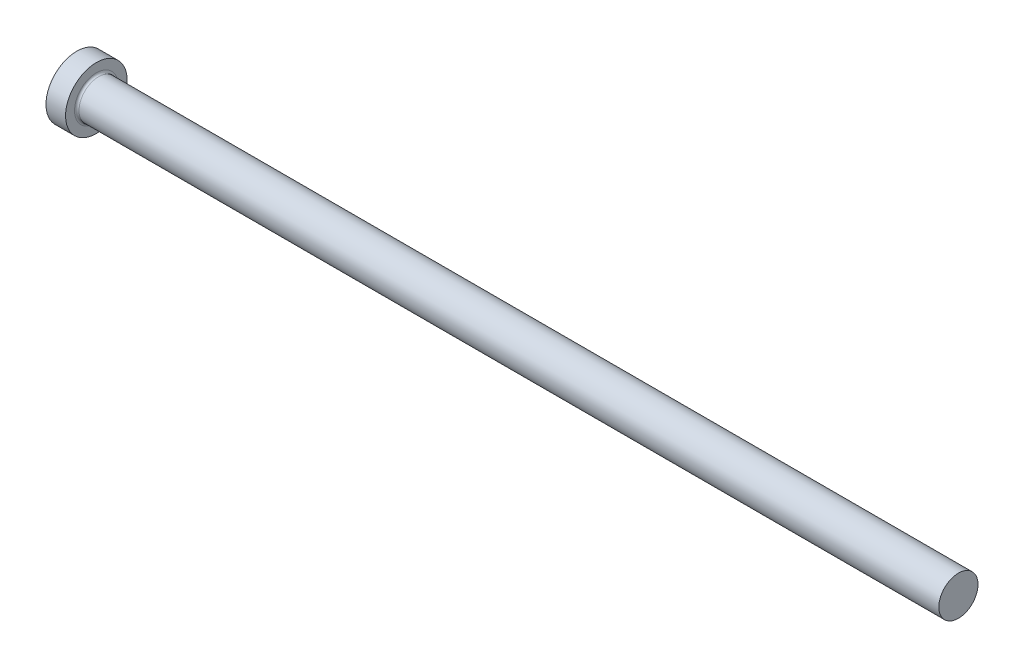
ISO-10303-21;
HEADER;
FILE_DESCRIPTION(('STEP AP214'),'2;1');
FILE_NAME('part.step','',(''),(''),'','','');
FILE_SCHEMA(('AUTOMOTIVE_DESIGN { 1 0 10303 214 1 1 1 1 }'));
ENDSEC;
DATA;
#1=APPLICATION_CONTEXT('core data for automotive mechanical design processes');
#2=APPLICATION_PROTOCOL_DEFINITION('international standard','automotive_design',2000,#1);
#3=PRODUCT_CONTEXT('',#1,'mechanical');
#4=PRODUCT('Part','Part','',(#3));
#5=PRODUCT_RELATED_PRODUCT_CATEGORY('part','',(#4));
#6=PRODUCT_DEFINITION_FORMATION('','',#4);
#7=PRODUCT_DEFINITION_CONTEXT('part definition',#1,'design');
#8=PRODUCT_DEFINITION('design','',#6,#7);
#9=PRODUCT_DEFINITION_SHAPE('','',#8);
#10=(LENGTH_UNIT() NAMED_UNIT(*) SI_UNIT(.MILLI.,.METRE.));
#11=(NAMED_UNIT(*) PLANE_ANGLE_UNIT() SI_UNIT($,.RADIAN.));
#12=(NAMED_UNIT(*) SI_UNIT($,.STERADIAN.) SOLID_ANGLE_UNIT());
#13=UNCERTAINTY_MEASURE_WITH_UNIT(LENGTH_MEASURE(1.E-05),#10,'distance_accuracy_value','');
#14=(GEOMETRIC_REPRESENTATION_CONTEXT(3) GLOBAL_UNCERTAINTY_ASSIGNED_CONTEXT((#13)) GLOBAL_UNIT_ASSIGNED_CONTEXT((#10,
#11,#12)) REPRESENTATION_CONTEXT('',''));
#15=CARTESIAN_POINT('',(0.,0.,0.));
#16=DIRECTION('',(0.,0.,1.));
#17=DIRECTION('',(1.,0.,0.));
#18=AXIS2_PLACEMENT_3D('',#15,#16,#17);
#19=CARTESIAN_POINT('',(0.,0.,0.));
#20=DIRECTION('',(-1.,0.,0.));
#21=DIRECTION('',(0.,-1.,0.));
#22=AXIS2_PLACEMENT_3D('',#19,#20,#21);
#23=PLANE('',#22);
#24=CARTESIAN_POINT('',(0.,0.,0.));
#25=DIRECTION('',(1.,0.,0.));
#26=DIRECTION('',(0.,1.,0.));
#27=AXIS2_PLACEMENT_3D('',#24,#25,#26);
#28=CIRCLE('',#27,11.);
#29=CARTESIAN_POINT('',(0.,11.,0.));
#30=VERTEX_POINT('',#29);
#31=EDGE_CURVE('E25',#30,#30,#28,.T.);
#32=ORIENTED_EDGE('',*,*,#31,.F.);
#33=EDGE_LOOP('',(#32));
#34=FACE_BOUND('',#33,.T.);
#35=ADVANCED_FACE('F14',(#34),#23,.T.);
#36=CARTESIAN_POINT('',(315.,0.,0.));
#37=DIRECTION('',(1.,0.,0.));
#38=DIRECTION('',(0.,1.,0.));
#39=AXIS2_PLACEMENT_3D('',#36,#37,#38);
#40=CYLINDRICAL_SURFACE('',#39,11.);
#41=ORIENTED_EDGE('',*,*,#31,.T.);
#42=EDGE_LOOP('',(#41));
#43=FACE_BOUND('',#42,.T.);
#44=CARTESIAN_POINT('',(7.,0.,0.));
#45=DIRECTION('',(1.,0.,0.));
#46=DIRECTION('',(0.,1.,0.));
#47=AXIS2_PLACEMENT_3D('',#44,#45,#46);
#48=CIRCLE('',#47,11.);
#49=CARTESIAN_POINT('',(7.,11.,0.));
#50=VERTEX_POINT('',#49);
#51=EDGE_CURVE('E29',#50,#50,#48,.T.);
#52=ORIENTED_EDGE('',*,*,#51,.F.);
#53=EDGE_LOOP('',(#52));
#54=FACE_BOUND('',#53,.T.);
#55=ADVANCED_FACE('F51',(#43,#54),#40,.T.);
#56=CARTESIAN_POINT('',(7.,11.,0.));
#57=DIRECTION('',(1.,0.,0.));
#58=DIRECTION('',(0.,1.,0.));
#59=AXIS2_PLACEMENT_3D('',#56,#57,#58);
#60=PLANE('',#59);
#61=CARTESIAN_POINT('',(7.,0.,0.));
#62=DIRECTION('',(1.,0.,0.));
#63=DIRECTION('',(0.,1.,0.));
#64=AXIS2_PLACEMENT_3D('',#61,#62,#63);
#65=CIRCLE('',#64,7.8);
#66=CARTESIAN_POINT('',(7.,7.8,0.));
#67=VERTEX_POINT('',#66);
#68=EDGE_CURVE('E9',#67,#67,#65,.F.);
#69=ORIENTED_EDGE('',*,*,#68,.T.);
#70=EDGE_LOOP('',(#69));
#71=FACE_BOUND('',#70,.T.);
#72=ORIENTED_EDGE('',*,*,#51,.T.);
#73=EDGE_LOOP('',(#72));
#74=FACE_BOUND('',#73,.T.);
#75=ADVANCED_FACE('F42',(#71,#74),#60,.T.);
#76=CARTESIAN_POINT('',(315.,0.,0.));
#77=DIRECTION('',(1.,0.,0.));
#78=DIRECTION('',(0.,1.,0.));
#79=AXIS2_PLACEMENT_3D('',#76,#77,#78);
#80=CYLINDRICAL_SURFACE('',#79,7.);
#81=CARTESIAN_POINT('',(7.8,0.,0.));
#82=DIRECTION('',(1.,0.,0.));
#83=DIRECTION('',(0.,1.,0.));
#84=AXIS2_PLACEMENT_3D('',#81,#82,#83);
#85=CIRCLE('',#84,7.);
#86=CARTESIAN_POINT('',(7.8,7.,0.));
#87=VERTEX_POINT('',#86);
#88=EDGE_CURVE('E21',#87,#87,#85,.T.);
#89=ORIENTED_EDGE('',*,*,#88,.T.);
#90=EDGE_LOOP('',(#89));
#91=FACE_BOUND('',#90,.T.);
#92=CARTESIAN_POINT('',(315.,0.,0.));
#93=DIRECTION('',(1.,0.,0.));
#94=DIRECTION('',(0.,1.,0.));
#95=AXIS2_PLACEMENT_3D('',#92,#93,#94);
#96=CIRCLE('',#95,7.);
#97=CARTESIAN_POINT('',(315.,7.00000000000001,0.));
#98=VERTEX_POINT('',#97);
#99=EDGE_CURVE('E34',#98,#98,#96,.T.);
#100=ORIENTED_EDGE('',*,*,#99,.F.);
#101=EDGE_LOOP('',(#100));
#102=FACE_BOUND('',#101,.T.);
#103=ADVANCED_FACE('F40',(#91,#102),#80,.T.);
#104=CARTESIAN_POINT('',(315.,7.,0.));
#105=DIRECTION('',(1.,0.,0.));
#106=DIRECTION('',(0.,1.,0.));
#107=AXIS2_PLACEMENT_3D('',#104,#105,#106);
#108=PLANE('',#107);
#109=ORIENTED_EDGE('',*,*,#99,.T.);
#110=EDGE_LOOP('',(#109));
#111=FACE_BOUND('',#110,.T.);
#112=ADVANCED_FACE('F38',(#111),#108,.T.);
#113=CARTESIAN_POINT('',(7.8,0.,0.));
#114=DIRECTION('',(1.,0.,0.));
#115=DIRECTION('',(0.,1.,0.));
#116=AXIS2_PLACEMENT_3D('',#113,#114,#115);
#117=TOROIDAL_SURFACE('',#116,7.8,0.8);
#118=ORIENTED_EDGE('',*,*,#68,.F.);
#119=EDGE_LOOP('',(#118));
#120=FACE_BOUND('',#119,.T.);
#121=ORIENTED_EDGE('',*,*,#88,.F.);
#122=EDGE_LOOP('',(#121));
#123=FACE_BOUND('',#122,.T.);
#124=ADVANCED_FACE('F16',(#120,#123),#117,.F.);
#125=CLOSED_SHELL('',(#35,#55,#75,#103,#112,#124));
#126=MANIFOLD_SOLID_BREP('B1',#125);
#127=ADVANCED_BREP_SHAPE_REPRESENTATION('',(#18,#126),#14);
#128=SHAPE_DEFINITION_REPRESENTATION(#9,#127);
ENDSEC;
END-ISO-10303-21;
